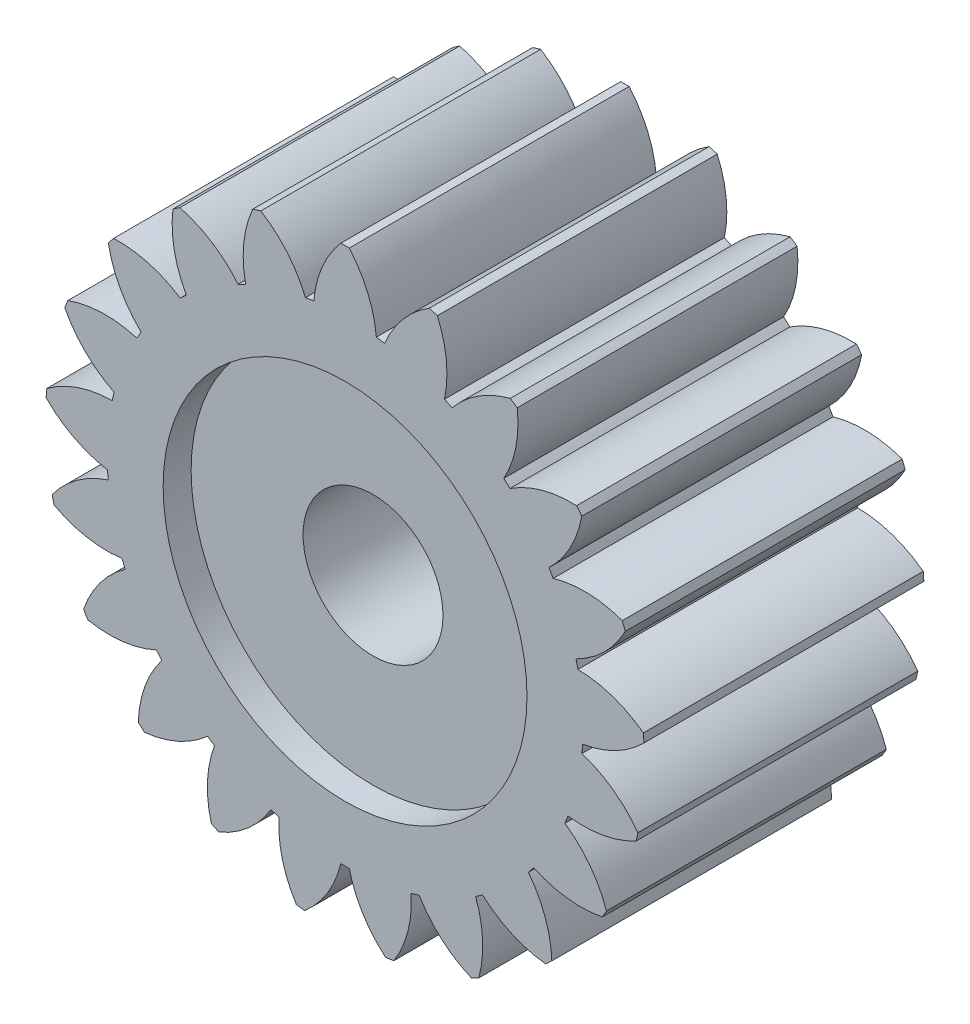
from build123d import *

# Parameters (mm, degrees)
ESQUISSE1_R                  = 10.7
BASE_EXTRUSION_DEPTH         = 10
ENL_V_MAT_EXTRU_2_DEPTH      = 19.137805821
R_P_TITION_CIRCULAIRE2_COUNT = 21
ESQUISSE5_R                  = 6.5
ENL_V_MAT_EXTRU_3_DEPTH      = 1
ENL_V_MAT_EXTRU_4_DEPTH      = 1.5
ESQUISSE7_R                  = 2.5
ENL_V_MAT_EXTRU_5_DEPTH      = 18.343804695


with BuildPart() as part:
    # Esquisse1 → Base-Extrusion (new body)
    with BuildSketch(Plane.XY):
        Circle(ESQUISSE1_R)
    extrude(amount=BASE_EXTRUSION_DEPTH)

    # Esquisse4 → Enl_v. mat.-Extru.2 (cut, through all)
    with BuildSketch(Plane.XY.offset(10)):
        with BuildLine():
            Line((1.266859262, 8.405062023), (2.058558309, 13.657641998))
            Line((2.058558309, 13.657641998), (-2.058558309, 13.657641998))
            Line((-2.058558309, 13.657641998), (-1.266859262, 8.405062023))
            ThreePointArc((-1.266859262, 8.405062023), (-1.192644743, 8.41591341), (-1.118337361, 8.426109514))
            ThreePointArc((-1.118337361, 8.426109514), (-0.814036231, 9.639161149), (-0.15, 10.698948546))
            ThreePointArc((-0.15, 10.698948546), (0, 10.7), (0.15, 10.698948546))
            ThreePointArc((0.15, 10.698948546), (0.814036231, 9.639161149), (1.118337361, 8.426109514))
            ThreePointArc((1.118337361, 8.426109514), (1.192644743, 8.41591341), (1.266859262, 8.405062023))
        make_face()
    enl_v_mat_extru_2 = extrude(amount=-ENL_V_MAT_EXTRU_2_DEPTH, mode=Mode.SUBTRACT)

    # R_p_tition circulaire2: Enl_v. mat.-Extru.2 ×21 about axis
    r_p_tition_circulaire2_axis = Axis((0, 0, 0), (0, 0, 1))
    for i in range(1, R_P_TITION_CIRCULAIRE2_COUNT):
        add(enl_v_mat_extru_2.rotate(r_p_tition_circulaire2_axis, i * 360 / R_P_TITION_CIRCULAIRE2_COUNT), mode=Mode.SUBTRACT)

    # Esquisse5 → Enl_v. mat.-Extru.3 (cut)
    with BuildSketch(Plane.XY.offset(10)):
        Circle(ESQUISSE5_R)
    extrude(amount=-ENL_V_MAT_EXTRU_3_DEPTH, mode=Mode.SUBTRACT)

    # Esquisse6 → Enl_v. mat.-Extru.4 (cut)
    with BuildSketch(Plane(origin=(0, 0, 0), x_dir=(-1, 0, 0), z_dir=(0, 0, -1))):
        with BuildLine():
            Line((2.384848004, 0.75), (5, 0.75))
            Line((5, 0.75), (5, -0.75))
            Line((5, -0.75), (2.384848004, -0.75))
            ThreePointArc((2.384848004, -0.75), (0, -2.5), (-2.384848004, -0.75))
            Line((-2.384848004, -0.75), (-5, -0.75))
            Line((-5, -0.75), (-5, 0.75))
            Line((-5, 0.75), (-2.384848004, 0.75))
            ThreePointArc((-2.384848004, 0.75), (0, 2.5), (2.384848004, 0.75))
        make_face()
    extrude(amount=-ENL_V_MAT_EXTRU_4_DEPTH, mode=Mode.SUBTRACT)

    # Esquisse7 → Enl_v. mat.-Extru.5 (cut, through all)
    with BuildSketch(Plane(origin=(0, 0, 1.5), x_dir=(-1, 0, 0), z_dir=(0, 0, -1))):
        with Locations(Location((0, 0, 0), (0, 0, 17.457603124))):
            Circle(ESQUISSE7_R)
    extrude(amount=-ENL_V_MAT_EXTRU_5_DEPTH, mode=Mode.SUBTRACT)


solid = part.part
